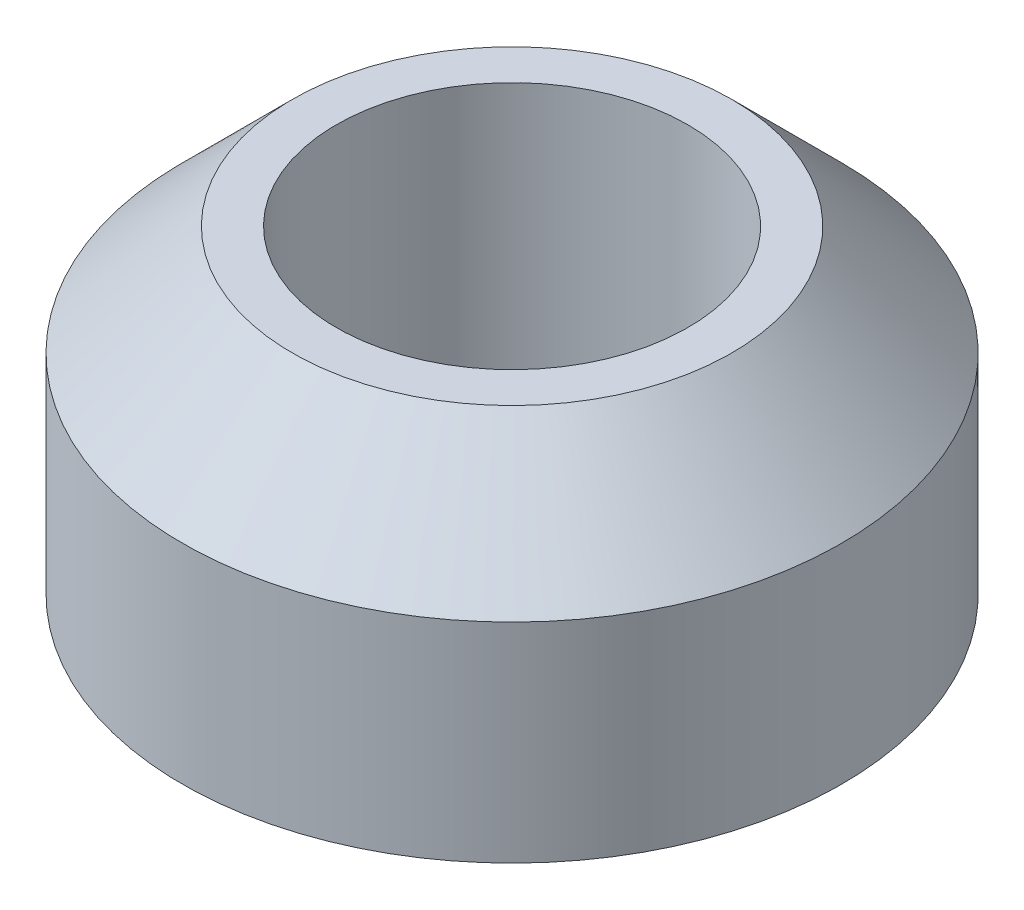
ISO-10303-21;
HEADER;
FILE_DESCRIPTION(('STEP AP214'),'2;1');
FILE_NAME('part.step','',(''),(''),'','','');
FILE_SCHEMA(('AUTOMOTIVE_DESIGN { 1 0 10303 214 1 1 1 1 }'));
ENDSEC;
DATA;
#1=APPLICATION_CONTEXT('core data for automotive mechanical design processes');
#2=APPLICATION_PROTOCOL_DEFINITION('international standard','automotive_design',2000,#1);
#3=PRODUCT_CONTEXT('',#1,'mechanical');
#4=PRODUCT('Part','Part','',(#3));
#5=PRODUCT_RELATED_PRODUCT_CATEGORY('part','',(#4));
#6=PRODUCT_DEFINITION_FORMATION('','',#4);
#7=PRODUCT_DEFINITION_CONTEXT('part definition',#1,'design');
#8=PRODUCT_DEFINITION('design','',#6,#7);
#9=PRODUCT_DEFINITION_SHAPE('','',#8);
#10=(LENGTH_UNIT() NAMED_UNIT(*) SI_UNIT(.MILLI.,.METRE.));
#11=(NAMED_UNIT(*) PLANE_ANGLE_UNIT() SI_UNIT($,.RADIAN.));
#12=(NAMED_UNIT(*) SI_UNIT($,.STERADIAN.) SOLID_ANGLE_UNIT());
#13=UNCERTAINTY_MEASURE_WITH_UNIT(LENGTH_MEASURE(1.E-05),#10,'distance_accuracy_value','');
#14=(GEOMETRIC_REPRESENTATION_CONTEXT(3) GLOBAL_UNCERTAINTY_ASSIGNED_CONTEXT((#13)) GLOBAL_UNIT_ASSIGNED_CONTEXT((#10,
#11,#12)) REPRESENTATION_CONTEXT('',''));
#15=CARTESIAN_POINT('',(0.,0.,0.));
#16=DIRECTION('',(0.,0.,1.));
#17=DIRECTION('',(1.,0.,0.));
#18=AXIS2_PLACEMENT_3D('',#15,#16,#17);
#19=CARTESIAN_POINT('',(0.,0.,0.));
#20=DIRECTION('',(0.,-1.,0.));
#21=DIRECTION('',(0.,0.,-1.));
#22=AXIS2_PLACEMENT_3D('',#19,#20,#21);
#23=CYLINDRICAL_SURFACE('',#22,15.);
#24=CARTESIAN_POINT('',(0.,0.,0.));
#25=DIRECTION('',(0.,-1.,0.));
#26=DIRECTION('',(0.,0.,-1.));
#27=AXIS2_PLACEMENT_3D('',#24,#25,#26);
#28=CIRCLE('',#27,15.);
#29=CARTESIAN_POINT('',(0.,0.,-15.));
#30=VERTEX_POINT('',#29);
#31=EDGE_CURVE('E10',#30,#30,#28,.T.);
#32=ORIENTED_EDGE('',*,*,#31,.F.);
#33=EDGE_LOOP('',(#32));
#34=FACE_BOUND('',#33,.T.);
#35=CARTESIAN_POINT('',(0.,9.5,0.));
#36=DIRECTION('',(0.,-1.,0.));
#37=DIRECTION('',(0.,0.,-1.));
#38=AXIS2_PLACEMENT_3D('',#35,#36,#37);
#39=CIRCLE('',#38,15.);
#40=CARTESIAN_POINT('',(0.,9.5,-15.));
#41=VERTEX_POINT('',#40);
#42=EDGE_CURVE('E45',#41,#41,#39,.T.);
#43=ORIENTED_EDGE('',*,*,#42,.T.);
#44=EDGE_LOOP('',(#43));
#45=FACE_BOUND('',#44,.T.);
#46=ADVANCED_FACE('F26',(#34,#45),#23,.T.);
#47=CARTESIAN_POINT('',(-8.,0.,0.));
#48=DIRECTION('',(0.,1.,0.));
#49=DIRECTION('',(0.,0.,1.));
#50=AXIS2_PLACEMENT_3D('',#47,#48,#49);
#51=PLANE('',#50);
#52=CARTESIAN_POINT('',(0.,0.,0.));
#53=DIRECTION('',(0.,-1.,0.));
#54=DIRECTION('',(0.,0.,-1.));
#55=AXIS2_PLACEMENT_3D('',#52,#53,#54);
#56=CIRCLE('',#55,8.);
#57=CARTESIAN_POINT('',(0.,0.,-8.));
#58=VERTEX_POINT('',#57);
#59=EDGE_CURVE('E32',#58,#58,#56,.T.);
#60=ORIENTED_EDGE('',*,*,#59,.F.);
#61=EDGE_LOOP('',(#60));
#62=FACE_BOUND('',#61,.T.);
#63=ORIENTED_EDGE('',*,*,#31,.T.);
#64=EDGE_LOOP('',(#63));
#65=FACE_BOUND('',#64,.T.);
#66=ADVANCED_FACE('F64',(#62,#65),#51,.F.);
#67=CARTESIAN_POINT('',(0.,0.,0.));
#68=DIRECTION('',(0.,-1.,0.));
#69=DIRECTION('',(0.,0.,-1.));
#70=AXIS2_PLACEMENT_3D('',#67,#68,#69);
#71=CYLINDRICAL_SURFACE('',#70,8.);
#72=CARTESIAN_POINT('',(0.,14.5,0.));
#73=DIRECTION('',(0.,-1.,0.));
#74=DIRECTION('',(0.,0.,-1.));
#75=AXIS2_PLACEMENT_3D('',#72,#73,#74);
#76=CIRCLE('',#75,8.);
#77=CARTESIAN_POINT('',(0.,14.5,-8.));
#78=VERTEX_POINT('',#77);
#79=EDGE_CURVE('E36',#78,#78,#76,.T.);
#80=ORIENTED_EDGE('',*,*,#79,.F.);
#81=EDGE_LOOP('',(#80));
#82=FACE_BOUND('',#81,.T.);
#83=ORIENTED_EDGE('',*,*,#59,.T.);
#84=EDGE_LOOP('',(#83));
#85=FACE_BOUND('',#84,.T.);
#86=ADVANCED_FACE('F59',(#82,#85),#71,.F.);
#87=CARTESIAN_POINT('',(-10.,14.5,0.));
#88=DIRECTION('',(0.,-1.,0.));
#89=DIRECTION('',(0.,0.,-1.));
#90=AXIS2_PLACEMENT_3D('',#87,#88,#89);
#91=PLANE('',#90);
#92=CARTESIAN_POINT('',(0.,14.5,0.));
#93=DIRECTION('',(0.,-1.,0.));
#94=DIRECTION('',(0.,0.,-1.));
#95=AXIS2_PLACEMENT_3D('',#92,#93,#94);
#96=CIRCLE('',#95,10.);
#97=CARTESIAN_POINT('',(0.,14.5,-10.));
#98=VERTEX_POINT('',#97);
#99=EDGE_CURVE('E40',#98,#98,#96,.T.);
#100=ORIENTED_EDGE('',*,*,#99,.F.);
#101=EDGE_LOOP('',(#100));
#102=FACE_BOUND('',#101,.T.);
#103=ORIENTED_EDGE('',*,*,#79,.T.);
#104=EDGE_LOOP('',(#103));
#105=FACE_BOUND('',#104,.T.);
#106=ADVANCED_FACE('F53',(#102,#105),#91,.F.);
#107=CARTESIAN_POINT('',(0.,14.5,0.));
#108=DIRECTION('',(0.,-1.,0.));
#109=DIRECTION('',(0.,0.,-1.));
#110=AXIS2_PLACEMENT_3D('',#107,#108,#109);
#111=CONICAL_SURFACE('',#110,10.,0.785398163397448);
#112=ORIENTED_EDGE('',*,*,#42,.F.);
#113=EDGE_LOOP('',(#112));
#114=FACE_BOUND('',#113,.T.);
#115=ORIENTED_EDGE('',*,*,#99,.T.);
#116=EDGE_LOOP('',(#115));
#117=FACE_BOUND('',#116,.T.);
#118=ADVANCED_FACE('F50',(#114,#117),#111,.T.);
#119=CLOSED_SHELL('',(#46,#66,#86,#106,#118));
#120=MANIFOLD_SOLID_BREP('B2',#119);
#121=ADVANCED_BREP_SHAPE_REPRESENTATION('',(#18,#120),#14);
#122=SHAPE_DEFINITION_REPRESENTATION(#9,#121);
ENDSEC;
END-ISO-10303-21;
